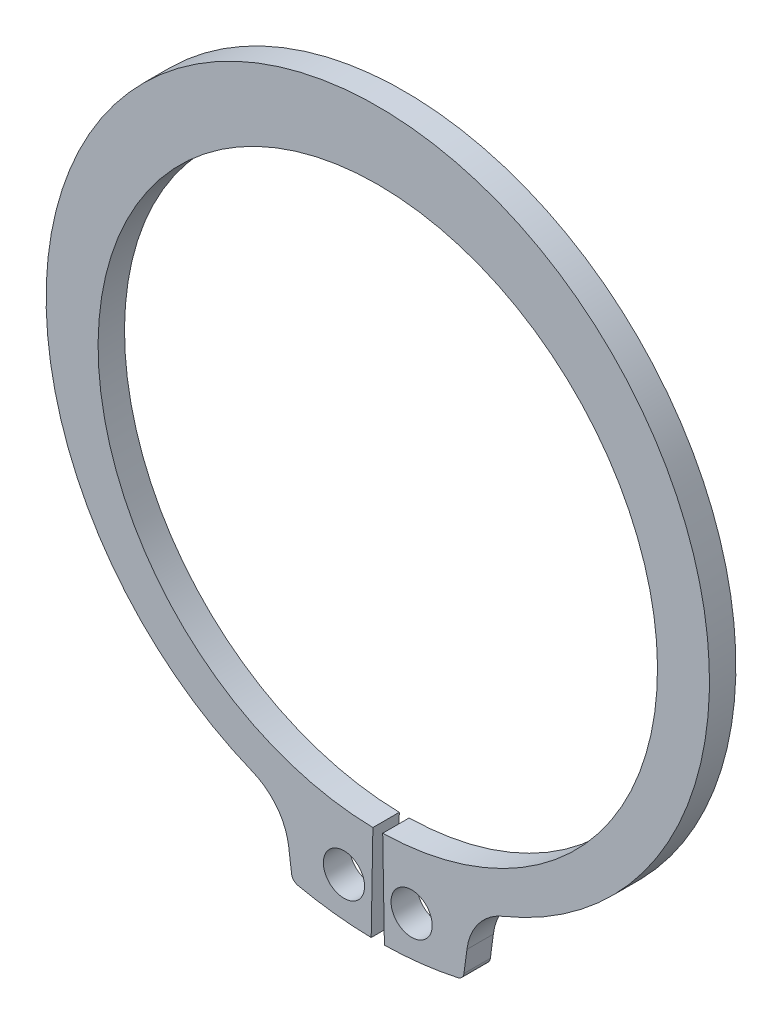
ISO-10303-21;
HEADER;
FILE_DESCRIPTION(('STEP AP214'),'2;1');
FILE_NAME('part.step','',(''),(''),'','','');
FILE_SCHEMA(('AUTOMOTIVE_DESIGN { 1 0 10303 214 1 1 1 1 }'));
ENDSEC;
DATA;
#1=APPLICATION_CONTEXT('core data for automotive mechanical design processes');
#2=APPLICATION_PROTOCOL_DEFINITION('international standard','automotive_design',2000,#1);
#3=PRODUCT_CONTEXT('',#1,'mechanical');
#4=PRODUCT('Part','Part','',(#3));
#5=PRODUCT_RELATED_PRODUCT_CATEGORY('part','',(#4));
#6=PRODUCT_DEFINITION_FORMATION('','',#4);
#7=PRODUCT_DEFINITION_CONTEXT('part definition',#1,'design');
#8=PRODUCT_DEFINITION('design','',#6,#7);
#9=PRODUCT_DEFINITION_SHAPE('','',#8);
#10=(LENGTH_UNIT() NAMED_UNIT(*) SI_UNIT(.MILLI.,.METRE.));
#11=(NAMED_UNIT(*) PLANE_ANGLE_UNIT() SI_UNIT($,.RADIAN.));
#12=(NAMED_UNIT(*) SI_UNIT($,.STERADIAN.) SOLID_ANGLE_UNIT());
#13=UNCERTAINTY_MEASURE_WITH_UNIT(LENGTH_MEASURE(1.E-05),#10,'distance_accuracy_value','');
#14=(GEOMETRIC_REPRESENTATION_CONTEXT(3) GLOBAL_UNCERTAINTY_ASSIGNED_CONTEXT((#13)) GLOBAL_UNIT_ASSIGNED_CONTEXT((#10,
#11,#12)) REPRESENTATION_CONTEXT('',''));
#15=CARTESIAN_POINT('',(0.,0.,0.));
#16=DIRECTION('',(0.,0.,1.));
#17=DIRECTION('',(1.,0.,0.));
#18=AXIS2_PLACEMENT_3D('',#15,#16,#17);
#19=CARTESIAN_POINT('',(0.,0.,-1.27));
#20=DIRECTION('',(0.,0.,1.));
#21=DIRECTION('',(1.,0.,0.));
#22=AXIS2_PLACEMENT_3D('',#19,#20,#21);
#23=CYLINDRICAL_SURFACE('',#22,13.4493);
#24=CARTESIAN_POINT('',(0.,0.,0.));
#25=DIRECTION('',(0.,0.,-1.));
#26=DIRECTION('',(1.,0.,0.));
#27=AXIS2_PLACEMENT_3D('',#24,#25,#26);
#28=CIRCLE('',#27,13.4493);
#29=CARTESIAN_POINT('',(-0.236284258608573,-13.447224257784,0.));
#30=VERTEX_POINT('',#29);
#31=CARTESIAN_POINT('',(0.236284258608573,-13.447224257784,0.));
#32=VERTEX_POINT('',#31);
#33=EDGE_CURVE('E149',#30,#32,#28,.T.);
#34=ORIENTED_EDGE('',*,*,#33,.F.);
#35=DIRECTION('',(0.,0.,1.));
#36=VECTOR('',#35,1.);
#37=CARTESIAN_POINT('',(-0.236284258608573,-13.447224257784,-1.27));
#38=LINE('',#37,#36);
#39=CARTESIAN_POINT('',(-0.236284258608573,-13.447224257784,-1.27));
#40=VERTEX_POINT('',#39);
#41=EDGE_CURVE('E11',#40,#30,#38,.T.);
#42=ORIENTED_EDGE('',*,*,#41,.F.);
#43=CARTESIAN_POINT('',(0.,0.,-1.27));
#44=DIRECTION('',(0.,0.,-1.));
#45=DIRECTION('',(1.,0.,0.));
#46=AXIS2_PLACEMENT_3D('',#43,#44,#45);
#47=CIRCLE('',#46,13.4493);
#48=CARTESIAN_POINT('',(0.236284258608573,-13.447224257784,-1.27));
#49=VERTEX_POINT('',#48);
#50=EDGE_CURVE('E182',#40,#49,#47,.T.);
#51=ORIENTED_EDGE('',*,*,#50,.T.);
#52=DIRECTION('',(0.,0.,1.));
#53=VECTOR('',#52,1.);
#54=CARTESIAN_POINT('',(0.236284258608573,-13.447224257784,-1.27));
#55=LINE('',#54,#53);
#56=EDGE_CURVE('E31',#49,#32,#55,.T.);
#57=ORIENTED_EDGE('',*,*,#56,.T.);
#58=EDGE_LOOP('',(#34,#42,#51,#57));
#59=FACE_BOUND('',#58,.T.);
#60=ADVANCED_FACE('F28',(#59),#23,.F.);
#61=CARTESIAN_POINT('',(-0.236284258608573,-13.447224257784,-1.27));
#62=DIRECTION('',(0.999845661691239,-0.0175685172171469,0.));
#63=DIRECTION('',(0.0175685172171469,0.999845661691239,0.));
#64=AXIS2_PLACEMENT_3D('',#61,#62,#63);
#65=PLANE('',#64);
#66=DIRECTION('',(0.0175685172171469,0.999845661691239,0.));
#67=VECTOR('',#66,1.);
#68=CARTESIAN_POINT('',(-0.236284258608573,-13.447224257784,0.));
#69=LINE('',#68,#67);
#70=CARTESIAN_POINT('',(-0.3175,-18.0693107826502,0.));
#71=VERTEX_POINT('',#70);
#72=EDGE_CURVE('E180',#71,#30,#69,.T.);
#73=ORIENTED_EDGE('',*,*,#72,.F.);
#74=DIRECTION('',(0.,0.,1.));
#75=VECTOR('',#74,1.);
#76=CARTESIAN_POINT('',(-0.3175,-18.0693107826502,-1.27));
#77=LINE('',#76,#75);
#78=CARTESIAN_POINT('',(-0.3175,-18.0693107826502,-1.27));
#79=VERTEX_POINT('',#78);
#80=EDGE_CURVE('E37',#79,#71,#77,.T.);
#81=ORIENTED_EDGE('',*,*,#80,.F.);
#82=DIRECTION('',(0.0175685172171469,0.999845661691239,0.));
#83=VECTOR('',#82,1.);
#84=CARTESIAN_POINT('',(-0.236284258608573,-13.447224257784,-1.27));
#85=LINE('',#84,#83);
#86=EDGE_CURVE('E139',#79,#40,#85,.T.);
#87=ORIENTED_EDGE('',*,*,#86,.T.);
#88=ORIENTED_EDGE('',*,*,#41,.T.);
#89=EDGE_LOOP('',(#73,#81,#87,#88));
#90=FACE_BOUND('',#89,.T.);
#91=ADVANCED_FACE('F202',(#90),#65,.T.);
#92=CARTESIAN_POINT('',(0.,0.,-1.27));
#93=DIRECTION('',(0.,0.,1.));
#94=DIRECTION('',(1.,0.,0.));
#95=AXIS2_PLACEMENT_3D('',#92,#93,#94);
#96=CYLINDRICAL_SURFACE('',#95,18.0721);
#97=CARTESIAN_POINT('',(0.,0.,0.));
#98=DIRECTION('',(0.,0.,1.));
#99=DIRECTION('',(1.,0.,0.));
#100=AXIS2_PLACEMENT_3D('',#97,#98,#99);
#101=CIRCLE('',#100,18.0721);
#102=CARTESIAN_POINT('',(-3.8470956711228,-17.6578779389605,0.));
#103=VERTEX_POINT('',#102);
#104=EDGE_CURVE('E126',#103,#71,#101,.T.);
#105=ORIENTED_EDGE('',*,*,#104,.F.);
#106=DIRECTION('',(0.,0.,1.));
#107=VECTOR('',#106,1.);
#108=CARTESIAN_POINT('',(-3.8470956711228,-17.6578779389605,-1.27));
#109=LINE('',#108,#107);
#110=CARTESIAN_POINT('',(-3.8470956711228,-17.6578779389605,-1.27));
#111=VERTEX_POINT('',#110);
#112=EDGE_CURVE('E121',#111,#103,#109,.T.);
#113=ORIENTED_EDGE('',*,*,#112,.F.);
#114=CARTESIAN_POINT('',(0.,0.,-1.27));
#115=DIRECTION('',(0.,0.,1.));
#116=DIRECTION('',(1.,0.,0.));
#117=AXIS2_PLACEMENT_3D('',#114,#115,#116);
#118=CIRCLE('',#117,18.0721);
#119=EDGE_CURVE('E124',#111,#79,#118,.T.);
#120=ORIENTED_EDGE('',*,*,#119,.T.);
#121=ORIENTED_EDGE('',*,*,#80,.T.);
#122=EDGE_LOOP('',(#105,#113,#120,#121));
#123=FACE_BOUND('',#122,.T.);
#124=ADVANCED_FACE('F123',(#123),#96,.T.);
#125=CARTESIAN_POINT('',(-3.76599035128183,-17.2856106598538,-1.27));
#126=DIRECTION('',(0.,0.,1.));
#127=DIRECTION('',(1.,0.,0.));
#128=AXIS2_PLACEMENT_3D('',#125,#126,#127);
#129=CYLINDRICAL_SURFACE('',#128,0.380999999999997);
#130=CARTESIAN_POINT('',(-3.76599035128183,-17.2856106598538,0.));
#131=DIRECTION('',(0.,0.,1.));
#132=DIRECTION('',(1.,0.,0.));
#133=AXIS2_PLACEMENT_3D('',#130,#131,#132);
#134=CIRCLE('',#133,0.380999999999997);
#135=CARTESIAN_POINT('',(-4.14373084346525,-17.3353411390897,0.));
#136=VERTEX_POINT('',#135);
#137=EDGE_CURVE('E177',#136,#103,#134,.T.);
#138=ORIENTED_EDGE('',*,*,#137,.F.);
#139=DIRECTION('',(0.,0.,1.));
#140=VECTOR('',#139,1.);
#141=CARTESIAN_POINT('',(-4.14373084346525,-17.3353411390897,-1.27));
#142=LINE('',#141,#140);
#143=CARTESIAN_POINT('',(-4.14373084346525,-17.3353411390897,-1.27));
#144=VERTEX_POINT('',#143);
#145=EDGE_CURVE('E131',#144,#136,#142,.T.);
#146=ORIENTED_EDGE('',*,*,#145,.F.);
#147=CARTESIAN_POINT('',(-3.76599035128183,-17.2856106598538,-1.27));
#148=DIRECTION('',(0.,0.,1.));
#149=DIRECTION('',(1.,0.,0.));
#150=AXIS2_PLACEMENT_3D('',#147,#148,#149);
#151=CIRCLE('',#150,0.380999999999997);
#152=EDGE_CURVE('E137',#144,#111,#151,.T.);
#153=ORIENTED_EDGE('',*,*,#152,.T.);
#154=ORIENTED_EDGE('',*,*,#112,.T.);
#155=EDGE_LOOP('',(#138,#146,#153,#154));
#156=FACE_BOUND('',#155,.T.);
#157=ADVANCED_FACE('F141',(#156),#129,.T.);
#158=CARTESIAN_POINT('',(-4.28537299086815,-16.2594622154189,-1.27));
#159=DIRECTION('',(-0.99144486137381,-0.130526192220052,0.));
#160=DIRECTION('',(0.130526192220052,-0.99144486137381,0.));
#161=AXIS2_PLACEMENT_3D('',#158,#159,#160);
#162=PLANE('',#161);
#163=DIRECTION('',(0.130526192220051,-0.99144486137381,0.));
#164=VECTOR('',#163,1.);
#165=CARTESIAN_POINT('',(-4.28537299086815,-16.2594622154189,0.));
#166=LINE('',#165,#164);
#167=CARTESIAN_POINT('',(-4.28537299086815,-16.2594622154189,0.));
#168=VERTEX_POINT('',#167);
#169=EDGE_CURVE('E174',#168,#136,#166,.T.);
#170=ORIENTED_EDGE('',*,*,#169,.F.);
#171=DIRECTION('',(0.,0.,1.));
#172=VECTOR('',#171,1.);
#173=CARTESIAN_POINT('',(-4.28537299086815,-16.2594622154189,-1.27));
#174=LINE('',#173,#172);
#175=CARTESIAN_POINT('',(-4.28537299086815,-16.2594622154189,-1.27));
#176=VERTEX_POINT('',#175);
#177=EDGE_CURVE('E186',#176,#168,#174,.T.);
#178=ORIENTED_EDGE('',*,*,#177,.F.);
#179=DIRECTION('',(0.130526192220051,-0.99144486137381,0.));
#180=VECTOR('',#179,1.);
#181=CARTESIAN_POINT('',(-4.28537299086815,-16.2594622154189,-1.27));
#182=LINE('',#181,#180);
#183=EDGE_CURVE('E142',#176,#144,#182,.T.);
#184=ORIENTED_EDGE('',*,*,#183,.T.);
#185=ORIENTED_EDGE('',*,*,#145,.T.);
#186=EDGE_LOOP('',(#170,#178,#184,#185));
#187=FACE_BOUND('',#186,.T.);
#188=ADVANCED_FACE('F215',(#187),#162,.T.);
#189=CARTESIAN_POINT('',(-7.08024659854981,-16.6274143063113,-1.27));
#190=DIRECTION('',(0.,0.,1.));
#191=DIRECTION('',(1.,0.,0.));
#192=AXIS2_PLACEMENT_3D('',#189,#190,#191);
#193=CYLINDRICAL_SURFACE('',#192,2.81899046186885);
#194=CARTESIAN_POINT('',(-7.08024659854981,-16.6274143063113,0.));
#195=DIRECTION('',(0.,0.,-1.));
#196=DIRECTION('',(1.,0.,0.));
#197=AXIS2_PLACEMENT_3D('',#194,#195,#196);
#198=CIRCLE('',#197,2.81899046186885);
#199=CARTESIAN_POINT('',(-6.01671569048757,-14.016742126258,0.));
#200=VERTEX_POINT('',#199);
#201=EDGE_CURVE('E171',#200,#168,#198,.T.);
#202=ORIENTED_EDGE('',*,*,#201,.F.);
#203=DIRECTION('',(0.,0.,1.));
#204=VECTOR('',#203,1.);
#205=CARTESIAN_POINT('',(-6.01671569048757,-14.016742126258,-1.27));
#206=LINE('',#205,#204);
#207=CARTESIAN_POINT('',(-6.01671569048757,-14.016742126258,-1.27));
#208=VERTEX_POINT('',#207);
#209=EDGE_CURVE('E188',#208,#200,#206,.T.);
#210=ORIENTED_EDGE('',*,*,#209,.F.);
#211=CARTESIAN_POINT('',(-7.08024659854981,-16.6274143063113,-1.27));
#212=DIRECTION('',(0.,0.,-1.));
#213=DIRECTION('',(1.,0.,0.));
#214=AXIS2_PLACEMENT_3D('',#211,#212,#213);
#215=CIRCLE('',#214,2.81899046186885);
#216=EDGE_CURVE('E144',#208,#176,#215,.T.);
#217=ORIENTED_EDGE('',*,*,#216,.T.);
#218=ORIENTED_EDGE('',*,*,#177,.T.);
#219=EDGE_LOOP('',(#202,#210,#217,#218));
#220=FACE_BOUND('',#219,.T.);
#221=ADVANCED_FACE('F218',(#220),#193,.F.);
#222=CARTESIAN_POINT('',(0.,0.752619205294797,-1.27));
#223=DIRECTION('',(0.,0.,1.));
#224=DIRECTION('',(1.,0.,0.));
#225=AXIS2_PLACEMENT_3D('',#222,#223,#224);
#226=CYLINDRICAL_SURFACE('',#225,15.9478807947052);
#227=CARTESIAN_POINT('',(0.,0.752619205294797,0.));
#228=DIRECTION('',(0.,0.,1.));
#229=DIRECTION('',(1.,0.,0.));
#230=AXIS2_PLACEMENT_3D('',#227,#228,#229);
#231=CIRCLE('',#230,15.9478807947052);
#232=CARTESIAN_POINT('',(6.01671569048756,-14.016742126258,0.));
#233=VERTEX_POINT('',#232);
#234=EDGE_CURVE('E168',#233,#200,#231,.T.);
#235=ORIENTED_EDGE('',*,*,#234,.F.);
#236=DIRECTION('',(0.,0.,1.));
#237=VECTOR('',#236,1.);
#238=CARTESIAN_POINT('',(6.01671569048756,-14.016742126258,-1.27));
#239=LINE('',#238,#237);
#240=CARTESIAN_POINT('',(6.01671569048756,-14.016742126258,-1.27));
#241=VERTEX_POINT('',#240);
#242=EDGE_CURVE('E190',#241,#233,#239,.T.);
#243=ORIENTED_EDGE('',*,*,#242,.F.);
#244=CARTESIAN_POINT('',(0.,0.752619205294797,-1.27));
#245=DIRECTION('',(0.,0.,1.));
#246=DIRECTION('',(1.,0.,0.));
#247=AXIS2_PLACEMENT_3D('',#244,#245,#246);
#248=CIRCLE('',#247,15.9478807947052);
#249=EDGE_CURVE('E292',#241,#208,#248,.T.);
#250=ORIENTED_EDGE('',*,*,#249,.T.);
#251=ORIENTED_EDGE('',*,*,#209,.T.);
#252=EDGE_LOOP('',(#235,#243,#250,#251));
#253=FACE_BOUND('',#252,.T.);
#254=ADVANCED_FACE('F222',(#253),#226,.T.);
#255=CARTESIAN_POINT('',(7.08024659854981,-16.6274143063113,-1.27));
#256=DIRECTION('',(0.,0.,1.));
#257=DIRECTION('',(1.,0.,0.));
#258=AXIS2_PLACEMENT_3D('',#255,#256,#257);
#259=CYLINDRICAL_SURFACE('',#258,2.81899046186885);
#260=CARTESIAN_POINT('',(7.08024659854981,-16.6274143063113,0.));
#261=DIRECTION('',(0.,0.,-1.));
#262=DIRECTION('',(1.,0.,0.));
#263=AXIS2_PLACEMENT_3D('',#260,#261,#262);
#264=CIRCLE('',#263,2.81899046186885);
#265=CARTESIAN_POINT('',(4.28537299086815,-16.2594622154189,0.));
#266=VERTEX_POINT('',#265);
#267=EDGE_CURVE('E165',#266,#233,#264,.T.);
#268=ORIENTED_EDGE('',*,*,#267,.F.);
#269=DIRECTION('',(0.,0.,1.));
#270=VECTOR('',#269,1.);
#271=CARTESIAN_POINT('',(4.28537299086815,-16.2594622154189,-1.27));
#272=LINE('',#271,#270);
#273=CARTESIAN_POINT('',(4.28537299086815,-16.2594622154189,-1.27));
#274=VERTEX_POINT('',#273);
#275=EDGE_CURVE('E192',#274,#266,#272,.T.);
#276=ORIENTED_EDGE('',*,*,#275,.F.);
#277=CARTESIAN_POINT('',(7.08024659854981,-16.6274143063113,-1.27));
#278=DIRECTION('',(0.,0.,-1.));
#279=DIRECTION('',(1.,0.,0.));
#280=AXIS2_PLACEMENT_3D('',#277,#278,#279);
#281=CIRCLE('',#280,2.81899046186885);
#282=EDGE_CURVE('E289',#274,#241,#281,.T.);
#283=ORIENTED_EDGE('',*,*,#282,.T.);
#284=ORIENTED_EDGE('',*,*,#242,.T.);
#285=EDGE_LOOP('',(#268,#276,#283,#284));
#286=FACE_BOUND('',#285,.T.);
#287=ADVANCED_FACE('F226',(#286),#259,.F.);
#288=CARTESIAN_POINT('',(4.28537299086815,-16.2594622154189,-1.27));
#289=DIRECTION('',(0.99144486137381,-0.130526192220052,0.));
#290=DIRECTION('',(0.130526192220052,0.99144486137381,0.));
#291=AXIS2_PLACEMENT_3D('',#288,#289,#290);
#292=PLANE('',#291);
#293=DIRECTION('',(0.130526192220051,0.99144486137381,0.));
#294=VECTOR('',#293,1.);
#295=CARTESIAN_POINT('',(4.28537299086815,-16.2594622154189,0.));
#296=LINE('',#295,#294);
#297=CARTESIAN_POINT('',(4.14373084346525,-17.3353411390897,0.));
#298=VERTEX_POINT('',#297);
#299=EDGE_CURVE('E162',#298,#266,#296,.T.);
#300=ORIENTED_EDGE('',*,*,#299,.F.);
#301=DIRECTION('',(0.,0.,1.));
#302=VECTOR('',#301,1.);
#303=CARTESIAN_POINT('',(4.14373084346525,-17.3353411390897,-1.27));
#304=LINE('',#303,#302);
#305=CARTESIAN_POINT('',(4.14373084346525,-17.3353411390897,-1.27));
#306=VERTEX_POINT('',#305);
#307=EDGE_CURVE('E194',#306,#298,#304,.T.);
#308=ORIENTED_EDGE('',*,*,#307,.F.);
#309=DIRECTION('',(0.130526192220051,0.99144486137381,0.));
#310=VECTOR('',#309,1.);
#311=CARTESIAN_POINT('',(4.28537299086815,-16.2594622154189,-1.27));
#312=LINE('',#311,#310);
#313=EDGE_CURVE('E286',#306,#274,#312,.T.);
#314=ORIENTED_EDGE('',*,*,#313,.T.);
#315=ORIENTED_EDGE('',*,*,#275,.T.);
#316=EDGE_LOOP('',(#300,#308,#314,#315));
#317=FACE_BOUND('',#316,.T.);
#318=ADVANCED_FACE('F230',(#317),#292,.T.);
#319=CARTESIAN_POINT('',(3.76599035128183,-17.2856106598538,-1.27));
#320=DIRECTION('',(0.,0.,1.));
#321=DIRECTION('',(1.,0.,0.));
#322=AXIS2_PLACEMENT_3D('',#319,#320,#321);
#323=CYLINDRICAL_SURFACE('',#322,0.380999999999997);
#324=CARTESIAN_POINT('',(3.76599035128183,-17.2856106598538,0.));
#325=DIRECTION('',(0.,0.,1.));
#326=DIRECTION('',(-1.,0.,0.));
#327=AXIS2_PLACEMENT_3D('',#324,#325,#326);
#328=CIRCLE('',#327,0.380999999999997);
#329=CARTESIAN_POINT('',(3.84709567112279,-17.6578779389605,0.));
#330=VERTEX_POINT('',#329);
#331=EDGE_CURVE('E159',#330,#298,#328,.T.);
#332=ORIENTED_EDGE('',*,*,#331,.F.);
#333=DIRECTION('',(0.,0.,1.));
#334=VECTOR('',#333,1.);
#335=CARTESIAN_POINT('',(3.84709567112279,-17.6578779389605,-1.27));
#336=LINE('',#335,#334);
#337=CARTESIAN_POINT('',(3.84709567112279,-17.6578779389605,-1.27));
#338=VERTEX_POINT('',#337);
#339=EDGE_CURVE('E196',#338,#330,#336,.T.);
#340=ORIENTED_EDGE('',*,*,#339,.F.);
#341=CARTESIAN_POINT('',(3.76599035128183,-17.2856106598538,-1.27));
#342=DIRECTION('',(0.,0.,1.));
#343=DIRECTION('',(-1.,0.,0.));
#344=AXIS2_PLACEMENT_3D('',#341,#342,#343);
#345=CIRCLE('',#344,0.380999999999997);
#346=EDGE_CURVE('E283',#338,#306,#345,.T.);
#347=ORIENTED_EDGE('',*,*,#346,.T.);
#348=ORIENTED_EDGE('',*,*,#307,.T.);
#349=EDGE_LOOP('',(#332,#340,#347,#348));
#350=FACE_BOUND('',#349,.T.);
#351=ADVANCED_FACE('F234',(#350),#323,.T.);
#352=CARTESIAN_POINT('',(0.,0.,-1.27));
#353=DIRECTION('',(0.,0.,1.));
#354=DIRECTION('',(1.,0.,0.));
#355=AXIS2_PLACEMENT_3D('',#352,#353,#354);
#356=CYLINDRICAL_SURFACE('',#355,18.0721);
#357=CARTESIAN_POINT('',(0.,0.,0.));
#358=DIRECTION('',(0.,0.,1.));
#359=DIRECTION('',(1.,0.,0.));
#360=AXIS2_PLACEMENT_3D('',#357,#358,#359);
#361=CIRCLE('',#360,18.0721);
#362=CARTESIAN_POINT('',(0.317500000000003,-18.0693107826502,0.));
#363=VERTEX_POINT('',#362);
#364=EDGE_CURVE('E156',#363,#330,#361,.T.);
#365=ORIENTED_EDGE('',*,*,#364,.F.);
#366=DIRECTION('',(0.,0.,1.));
#367=VECTOR('',#366,1.);
#368=CARTESIAN_POINT('',(0.317500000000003,-18.0693107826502,-1.27));
#369=LINE('',#368,#367);
#370=CARTESIAN_POINT('',(0.317500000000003,-18.0693107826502,-1.27));
#371=VERTEX_POINT('',#370);
#372=EDGE_CURVE('E197',#371,#363,#369,.T.);
#373=ORIENTED_EDGE('',*,*,#372,.F.);
#374=CARTESIAN_POINT('',(0.,0.,-1.27));
#375=DIRECTION('',(0.,0.,1.));
#376=DIRECTION('',(1.,0.,0.));
#377=AXIS2_PLACEMENT_3D('',#374,#375,#376);
#378=CIRCLE('',#377,18.0721);
#379=EDGE_CURVE('E280',#371,#338,#378,.T.);
#380=ORIENTED_EDGE('',*,*,#379,.T.);
#381=ORIENTED_EDGE('',*,*,#339,.T.);
#382=EDGE_LOOP('',(#365,#373,#380,#381));
#383=FACE_BOUND('',#382,.T.);
#384=ADVANCED_FACE('F238',(#383),#356,.T.);
#385=CARTESIAN_POINT('',(0.236284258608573,-13.447224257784,-1.27));
#386=DIRECTION('',(-0.999845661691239,-0.0175685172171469,0.));
#387=DIRECTION('',(0.0175685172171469,-0.999845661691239,0.));
#388=AXIS2_PLACEMENT_3D('',#385,#386,#387);
#389=PLANE('',#388);
#390=DIRECTION('',(0.0175685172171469,-0.999845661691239,0.));
#391=VECTOR('',#390,1.);
#392=CARTESIAN_POINT('',(0.236284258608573,-13.447224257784,0.));
#393=LINE('',#392,#391);
#394=EDGE_CURVE('E152',#32,#363,#393,.T.);
#395=ORIENTED_EDGE('',*,*,#394,.F.);
#396=ORIENTED_EDGE('',*,*,#56,.F.);
#397=DIRECTION('',(0.0175685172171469,-0.999845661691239,0.));
#398=VECTOR('',#397,1.);
#399=CARTESIAN_POINT('',(0.236284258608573,-13.447224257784,-1.27));
#400=LINE('',#399,#398);
#401=EDGE_CURVE('E278',#49,#371,#400,.T.);
#402=ORIENTED_EDGE('',*,*,#401,.T.);
#403=ORIENTED_EDGE('',*,*,#372,.T.);
#404=EDGE_LOOP('',(#395,#396,#402,#403));
#405=FACE_BOUND('',#404,.T.);
#406=ADVANCED_FACE('F199',(#405),#389,.T.);
#407=CARTESIAN_POINT('',(0.,0.,-1.27));
#408=DIRECTION('',(0.,0.,1.));
#409=DIRECTION('',(1.,0.,0.));
#410=AXIS2_PLACEMENT_3D('',#407,#408,#409);
#411=PLANE('',#410);
#412=CARTESIAN_POINT('',(-1.6256,-16.0979300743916,-1.27));
#413=DIRECTION('',(0.,0.,1.));
#414=DIRECTION('',(1.,0.,0.));
#415=AXIS2_PLACEMENT_3D('',#412,#413,#414);
#416=CIRCLE('',#415,0.9906);
#417=CARTESIAN_POINT('',(-0.635,-16.0979300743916,-1.27));
#418=VERTEX_POINT('',#417);
#419=EDGE_CURVE('E265',#418,#418,#416,.T.);
#420=ORIENTED_EDGE('',*,*,#419,.T.);
#421=EDGE_LOOP('',(#420));
#422=FACE_BOUND('',#421,.T.);
#423=CARTESIAN_POINT('',(1.6256,-16.0979300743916,-1.27));
#424=DIRECTION('',(0.,0.,1.));
#425=DIRECTION('',(1.,0.,0.));
#426=AXIS2_PLACEMENT_3D('',#423,#424,#425);
#427=CIRCLE('',#426,0.9906);
#428=CARTESIAN_POINT('',(2.6162,-16.0979300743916,-1.27));
#429=VERTEX_POINT('',#428);
#430=EDGE_CURVE('E153',#429,#429,#427,.T.);
#431=ORIENTED_EDGE('',*,*,#430,.T.);
#432=EDGE_LOOP('',(#431));
#433=FACE_BOUND('',#432,.T.);
#434=ORIENTED_EDGE('',*,*,#50,.F.);
#435=ORIENTED_EDGE('',*,*,#86,.F.);
#436=ORIENTED_EDGE('',*,*,#119,.F.);
#437=ORIENTED_EDGE('',*,*,#152,.F.);
#438=ORIENTED_EDGE('',*,*,#183,.F.);
#439=ORIENTED_EDGE('',*,*,#216,.F.);
#440=ORIENTED_EDGE('',*,*,#249,.F.);
#441=ORIENTED_EDGE('',*,*,#282,.F.);
#442=ORIENTED_EDGE('',*,*,#313,.F.);
#443=ORIENTED_EDGE('',*,*,#346,.F.);
#444=ORIENTED_EDGE('',*,*,#379,.F.);
#445=ORIENTED_EDGE('',*,*,#401,.F.);
#446=EDGE_LOOP('',(#434,#435,#436,#437,#438,#439,#440,#441,#442,#443,#444,#445));
#447=FACE_BOUND('',#446,.T.);
#448=ADVANCED_FACE('F135',(#422,#433,#447),#411,.F.);
#449=CARTESIAN_POINT('',(0.,0.,0.));
#450=DIRECTION('',(0.,0.,1.));
#451=DIRECTION('',(1.,0.,0.));
#452=AXIS2_PLACEMENT_3D('',#449,#450,#451);
#453=PLANE('',#452);
#454=CARTESIAN_POINT('',(-1.6256,-16.0979300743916,0.));
#455=DIRECTION('',(0.,0.,1.));
#456=DIRECTION('',(1.,0.,0.));
#457=AXIS2_PLACEMENT_3D('',#454,#455,#456);
#458=CIRCLE('',#457,0.9906);
#459=CARTESIAN_POINT('',(-0.635,-16.0979300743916,0.));
#460=VERTEX_POINT('',#459);
#461=EDGE_CURVE('E268',#460,#460,#458,.T.);
#462=ORIENTED_EDGE('',*,*,#461,.F.);
#463=EDGE_LOOP('',(#462));
#464=FACE_BOUND('',#463,.T.);
#465=CARTESIAN_POINT('',(1.6256,-16.0979300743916,0.));
#466=DIRECTION('',(0.,0.,1.));
#467=DIRECTION('',(1.,0.,0.));
#468=AXIS2_PLACEMENT_3D('',#465,#466,#467);
#469=CIRCLE('',#468,0.9906);
#470=CARTESIAN_POINT('',(2.6162,-16.0979300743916,0.));
#471=VERTEX_POINT('',#470);
#472=EDGE_CURVE('E270',#471,#471,#469,.T.);
#473=ORIENTED_EDGE('',*,*,#472,.F.);
#474=EDGE_LOOP('',(#473));
#475=FACE_BOUND('',#474,.T.);
#476=ORIENTED_EDGE('',*,*,#33,.T.);
#477=ORIENTED_EDGE('',*,*,#394,.T.);
#478=ORIENTED_EDGE('',*,*,#364,.T.);
#479=ORIENTED_EDGE('',*,*,#331,.T.);
#480=ORIENTED_EDGE('',*,*,#299,.T.);
#481=ORIENTED_EDGE('',*,*,#267,.T.);
#482=ORIENTED_EDGE('',*,*,#234,.T.);
#483=ORIENTED_EDGE('',*,*,#201,.T.);
#484=ORIENTED_EDGE('',*,*,#169,.T.);
#485=ORIENTED_EDGE('',*,*,#137,.T.);
#486=ORIENTED_EDGE('',*,*,#104,.T.);
#487=ORIENTED_EDGE('',*,*,#72,.T.);
#488=EDGE_LOOP('',(#476,#477,#478,#479,#480,#481,#482,#483,#484,#485,#486,#487));
#489=FACE_BOUND('',#488,.T.);
#490=ADVANCED_FACE('F201',(#464,#475,#489),#453,.T.);
#491=CARTESIAN_POINT('',(1.6256,-16.0979300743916,-1.27));
#492=DIRECTION('',(0.,0.,1.));
#493=DIRECTION('',(1.,0.,0.));
#494=AXIS2_PLACEMENT_3D('',#491,#492,#493);
#495=CYLINDRICAL_SURFACE('',#494,0.9906);
#496=ORIENTED_EDGE('',*,*,#430,.F.);
#497=EDGE_LOOP('',(#496));
#498=FACE_BOUND('',#497,.T.);
#499=ORIENTED_EDGE('',*,*,#472,.T.);
#500=EDGE_LOOP('',(#499));
#501=FACE_BOUND('',#500,.T.);
#502=ADVANCED_FACE('F250',(#498,#501),#495,.F.);
#503=CARTESIAN_POINT('',(-1.6256,-16.0979300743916,-1.27));
#504=DIRECTION('',(0.,0.,1.));
#505=DIRECTION('',(1.,0.,0.));
#506=AXIS2_PLACEMENT_3D('',#503,#504,#505);
#507=CYLINDRICAL_SURFACE('',#506,0.9906);
#508=ORIENTED_EDGE('',*,*,#419,.F.);
#509=EDGE_LOOP('',(#508));
#510=FACE_BOUND('',#509,.T.);
#511=ORIENTED_EDGE('',*,*,#461,.T.);
#512=EDGE_LOOP('',(#511));
#513=FACE_BOUND('',#512,.T.);
#514=ADVANCED_FACE('F257',(#510,#513),#507,.F.);
#515=CLOSED_SHELL('',(#60,#91,#124,#157,#188,#221,#254,#287,#318,#351,#384,#406,#448,#490,#502,#514));
#516=MANIFOLD_SOLID_BREP('B2',#515);
#517=ADVANCED_BREP_SHAPE_REPRESENTATION('',(#18,#516),#14);
#518=SHAPE_DEFINITION_REPRESENTATION(#9,#517);
ENDSEC;
END-ISO-10303-21;
